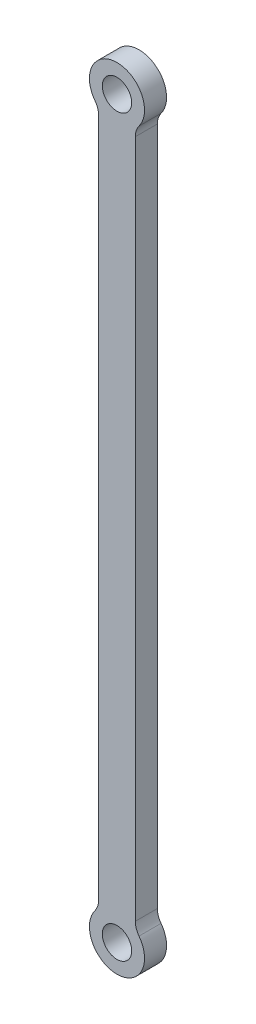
from build123d import *

# Parameters (mm, degrees)
CROQUIS1_R              = 4
SALIENTE_EXTRUIR1_DEPTH = 6


with BuildPart() as part:
    # Croquis1 → Saliente-Extruir1 (new body)
    with BuildSketch(Plane.XY):
        with BuildLine():
            ThreePointArc((6, 4.5), (5.25658351, 5.91886117), (5, 7.5))
            Line((5, 7.5), (5, 192.5))
            ThreePointArc((5, 192.5), (5.25658351, 194.08113883), (6, 195.5))
            ThreePointArc((6, 195.5), (0, 207.5), (-6, 195.5))
            ThreePointArc((-6, 195.5), (-5.25658351, 194.08113883), (-5, 192.5))
            Line((-5, 192.5), (-5, 7.5))
            ThreePointArc((-5, 7.5), (-5.25658351, 5.91886117), (-6, 4.5))
            ThreePointArc((-6, 4.5), (0, -7.5), (6, 4.5))
        make_face()
        Circle(CROQUIS1_R, mode=Mode.SUBTRACT)
        with Locations((0, 200)):
            Circle(CROQUIS1_R, mode=Mode.SUBTRACT)
    extrude(amount=SALIENTE_EXTRUIR1_DEPTH)


solid = part.part
